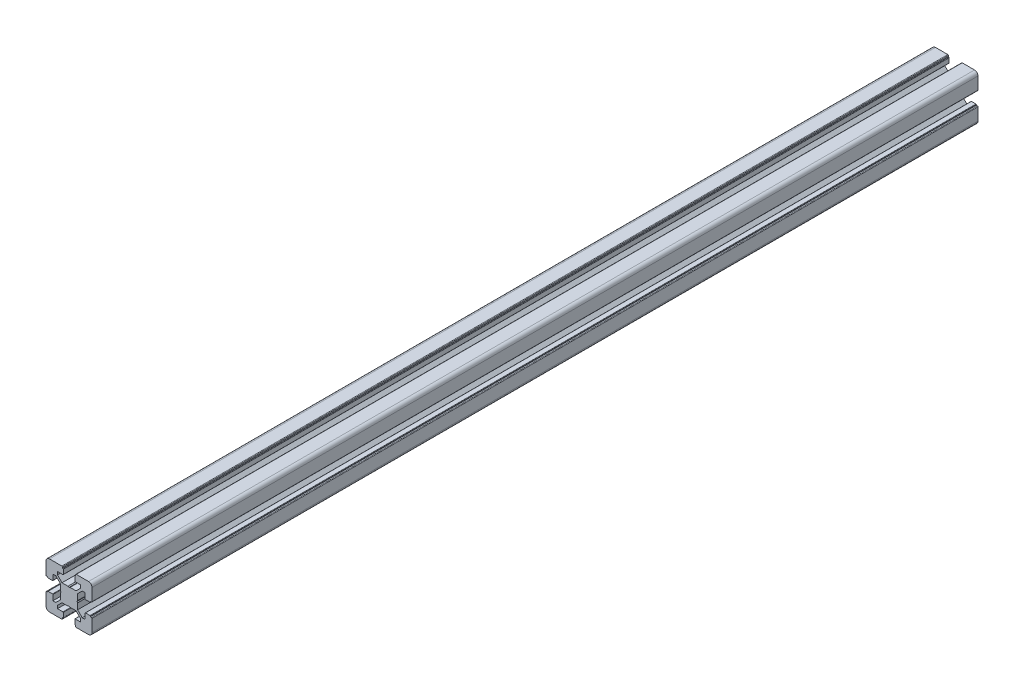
from build123d import *

# Parameters (mm, degrees)
BOSS_EXTRUDE1_DEPTH = 770


with BuildPart() as part:
    # Sketch2 → Boss-Extrude1 (new body)
    with BuildSketch(Plane.XY):
        with BuildLine():
            Line((-20.29996667, 9.949913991), (-20.29996667, 14.70003333))
            ThreePointArc((-20.29996667, 14.70003333), (-20.387834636, 14.912165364), (-20.59996667, 15.00003333))
            Line((-20.59996667, 15.00003333), (-24.49996667, 15.00003333))
            ThreePointArc((-24.49996667, 15.00003333), (-24.712098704, 14.912165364), (-24.79996667, 14.70003333))
            Line((-24.79996667, 14.70003333), (-24.79996667, 14.20003333))
            Line((-24.79996667, 14.20003333), (-25.79996667, 14.20003333))
            ThreePointArc((-25.79996667, 14.20003333), (-26.153520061, 14.053586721), (-26.29996667, 13.70003333))
            Line((-26.29996667, 13.70003333), (-26.29996667, 3))
            ThreePointArc((-26.29996667, 3), (-25.421287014, 0.878679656), (-23.29996667, 0))
            Line((-23.29996667, 0), (-12.6, 0))
            ThreePointArc((-12.6, 0), (-12.246446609, 0.146446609), (-12.1, 0.5))
            Line((-12.1, 0.5), (-12.1, 1.5))
            Line((-12.1, 1.5), (-11.6, 1.5))
            ThreePointArc((-11.6, 1.5), (-11.387867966, 1.587867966), (-11.3, 1.8))
            Line((-11.3, 1.8), (-11.3, 5.7))
            ThreePointArc((-11.3, 5.7), (-11.387867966, 5.912132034), (-11.6, 6))
            Line((-11.6, 6), (-16.350119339, 6))
            Line((-16.350119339, 6), (-16.350119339, 8.535633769))
            Line((-16.350119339, 8.535633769), (-12.385643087, 12.500110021))
            Line((-12.385643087, 12.500110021), (-7.165992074, 12.500110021))
            Line((-7.165992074, 12.500110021), (-6.29996667, 13.000110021))
            Line((-6.29996667, 13.000110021), (-5.433941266, 12.500110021))
            Line((-5.433941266, 12.500110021), (-0.214290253, 12.500110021))
            Line((-0.214290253, 12.500110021), (3.750119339, 8.535700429))
            Line((3.750119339, 8.535700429), (3.750119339, 6))
            Line((3.750119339, 6), (-1, 6))
            ThreePointArc((-1, 6), (-1.212132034, 5.912132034), (-1.3, 5.7))
            Line((-1.3, 5.7), (-1.3, 1.8))
            ThreePointArc((-1.3, 1.8), (-1.212132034, 1.587867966), (-1, 1.5))
            Line((-1, 1.5), (-0.5, 1.5))
            Line((-0.5, 1.5), (-0.5, 0.5))
            ThreePointArc((-0.5, 0.5), (-0.353553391, 0.146446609), (0, 0))
            Line((0, 0), (10.70003333, 0))
            ThreePointArc((10.70003333, 0), (12.821353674, 0.878679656), (13.70003333, 3))
            Line((13.70003333, 3), (13.70003333, 13.69996667))
            ThreePointArc((13.70003333, 13.69996667), (13.553586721, 14.053520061), (13.20003333, 14.19996667))
            Line((13.20003333, 14.19996667), (12.20003333, 14.19996667))
            Line((12.20003333, 14.19996667), (12.20003333, 14.69996667))
            ThreePointArc((12.20003333, 14.69996667), (12.112165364, 14.912098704), (11.90003333, 14.99996667))
            Line((11.90003333, 14.99996667), (8.00003333, 14.99996667))
            ThreePointArc((8.00003333, 14.99996667), (7.787901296, 14.912098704), (7.70003333, 14.69996667))
            Line((7.70003333, 14.69996667), (7.70003333, 9.949847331))
            Line((7.70003333, 9.949847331), (5.164399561, 9.949847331))
            Line((5.164399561, 9.949847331), (1.199923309, 13.914323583))
            Line((1.199923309, 13.914323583), (1.199923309, 19.133974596))
            Line((1.199923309, 19.133974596), (0.699923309, 20))
            Line((0.699923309, 20), (1.199923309, 20.866025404))
            Line((1.199923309, 20.866025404), (1.199923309, 26.085676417))
            Line((1.199923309, 26.085676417), (5.164332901, 30.050086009))
            Line((5.164332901, 30.050086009), (7.70003333, 30.050086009))
            Line((7.70003333, 30.050086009), (7.70003333, 25.29996667))
            ThreePointArc((7.70003333, 25.29996667), (7.787901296, 25.087834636), (8.00003333, 24.99996667))
            Line((8.00003333, 24.99996667), (11.90003333, 24.99996667))
            ThreePointArc((11.90003333, 24.99996667), (12.112165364, 25.087834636), (12.20003333, 25.29996667))
            Line((12.20003333, 25.29996667), (12.20003333, 25.79996667))
            Line((12.20003333, 25.79996667), (13.20003333, 25.79996667))
            ThreePointArc((13.20003333, 25.79996667), (13.553586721, 25.946413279), (13.70003333, 26.29996667))
            Line((13.70003333, 26.29996667), (13.70003333, 37))
            ThreePointArc((13.70003333, 37), (12.821353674, 39.121320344), (10.70003333, 40))
            Line((10.70003333, 40), (6.666e-05, 40))
            ThreePointArc((6.666e-05, 40), (-0.353486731, 39.853553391), (-0.49993334, 39.5))
            Line((-0.49993334, 39.5), (-0.49993334, 38.5))
            Line((-0.49993334, 38.5), (-0.99993334, 38.5))
            ThreePointArc((-0.99993334, 38.5), (-1.212065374, 38.412132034), (-1.29993334, 38.2))
            Line((-1.29993334, 38.2), (-1.29993334, 34.3))
            ThreePointArc((-1.29993334, 34.3), (-1.212065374, 34.087867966), (-0.99993334, 34))
            Line((-0.99993334, 34), (3.750185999, 34))
            Line((3.750185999, 34), (3.750185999, 31.464366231))
            Line((3.750185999, 31.464366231), (-0.214290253, 27.499889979))
            Line((-0.214290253, 27.499889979), (-5.433941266, 27.499889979))
            Line((-5.433941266, 27.499889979), (-6.29996667, 26.999889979))
            Line((-6.29996667, 26.999889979), (-7.165992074, 27.499889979))
            Line((-7.165992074, 27.499889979), (-12.385643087, 27.499889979))
            Line((-12.385643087, 27.499889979), (-16.350052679, 31.464299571))
            Line((-16.350052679, 31.464299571), (-16.350052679, 34))
            Line((-16.350052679, 34), (-11.59993334, 34))
            ThreePointArc((-11.59993334, 34), (-11.387801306, 34.087867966), (-11.29993334, 34.3))
            Line((-11.29993334, 34.3), (-11.29993334, 38.2))
            ThreePointArc((-11.29993334, 38.2), (-11.387801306, 38.412132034), (-11.59993334, 38.5))
            Line((-11.59993334, 38.5), (-12.09993334, 38.5))
            Line((-12.09993334, 38.5), (-12.09993334, 39.5))
            ThreePointArc((-12.09993334, 39.5), (-12.246379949, 39.853553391), (-12.59993334, 40))
            Line((-12.59993334, 40), (-23.29996667, 40))
            ThreePointArc((-23.29996667, 40), (-25.421287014, 39.121320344), (-26.29996667, 37))
            Line((-26.29996667, 37), (-26.29996667, 26.30003333))
            ThreePointArc((-26.29996667, 26.30003333), (-26.153520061, 25.946479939), (-25.79996667, 25.80003333))
            Line((-25.79996667, 25.80003333), (-24.79996667, 25.80003333))
            Line((-24.79996667, 25.80003333), (-24.79996667, 25.30003333))
            ThreePointArc((-24.79996667, 25.30003333), (-24.712098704, 25.087901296), (-24.49996667, 25.00003333))
            Line((-24.49996667, 25.00003333), (-20.59996667, 25.00003333))
            ThreePointArc((-20.59996667, 25.00003333), (-20.387834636, 25.087901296), (-20.29996667, 25.30003333))
            Line((-20.29996667, 25.30003333), (-20.29996667, 30.050152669))
            Line((-20.29996667, 30.050152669), (-17.764332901, 30.050152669))
            Line((-17.764332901, 30.050152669), (-13.799856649, 26.085676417))
            Line((-13.799856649, 26.085676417), (-13.799856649, 20.866025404))
            Line((-13.799856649, 20.866025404), (-13.299856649, 20))
            Line((-13.299856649, 20), (-13.799856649, 19.133974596))
            Line((-13.799856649, 19.133974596), (-13.799856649, 13.914323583))
            Line((-13.799856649, 13.914323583), (-17.764266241, 9.949913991))
            Line((-17.764266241, 9.949913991), (-20.29996667, 9.949913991))
        make_face()
    extrude(amount=BOSS_EXTRUDE1_DEPTH)


solid = part.part
